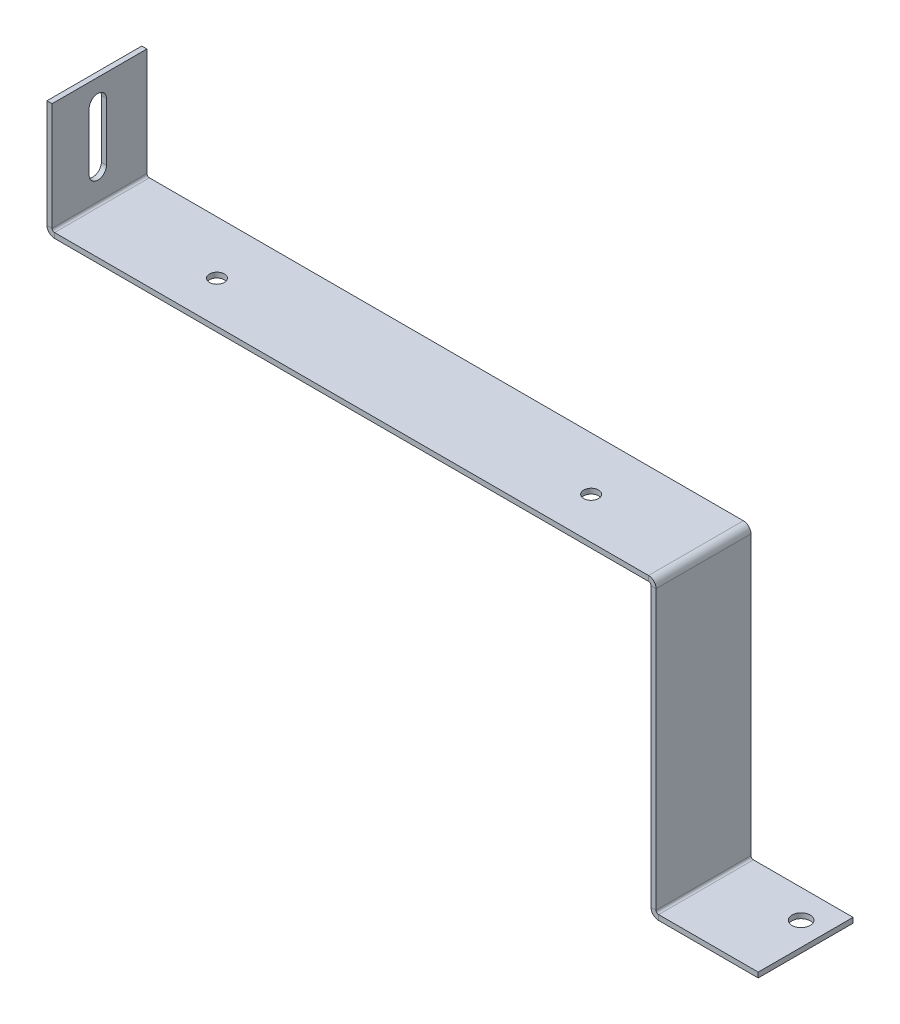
ISO-10303-21;
HEADER;
FILE_DESCRIPTION(('STEP AP214'),'2;1');
FILE_NAME('part.step','',(''),(''),'','','');
FILE_SCHEMA(('AUTOMOTIVE_DESIGN { 1 0 10303 214 1 1 1 1 }'));
ENDSEC;
DATA;
#1=APPLICATION_CONTEXT('core data for automotive mechanical design processes');
#2=APPLICATION_PROTOCOL_DEFINITION('international standard','automotive_design',2000,#1);
#3=PRODUCT_CONTEXT('',#1,'mechanical');
#4=PRODUCT('Part','Part','',(#3));
#5=PRODUCT_RELATED_PRODUCT_CATEGORY('part','',(#4));
#6=PRODUCT_DEFINITION_FORMATION('','',#4);
#7=PRODUCT_DEFINITION_CONTEXT('part definition',#1,'design');
#8=PRODUCT_DEFINITION('design','',#6,#7);
#9=PRODUCT_DEFINITION_SHAPE('','',#8);
#10=(LENGTH_UNIT() NAMED_UNIT(*) SI_UNIT(.MILLI.,.METRE.));
#11=(NAMED_UNIT(*) PLANE_ANGLE_UNIT() SI_UNIT($,.RADIAN.));
#12=(NAMED_UNIT(*) SI_UNIT($,.STERADIAN.) SOLID_ANGLE_UNIT());
#13=UNCERTAINTY_MEASURE_WITH_UNIT(LENGTH_MEASURE(1.E-05),#10,'distance_accuracy_value','');
#14=(GEOMETRIC_REPRESENTATION_CONTEXT(3) GLOBAL_UNCERTAINTY_ASSIGNED_CONTEXT((#13)) GLOBAL_UNIT_ASSIGNED_CONTEXT((#10,
#11,#12)) REPRESENTATION_CONTEXT('',''));
#15=CARTESIAN_POINT('',(0.,0.,0.));
#16=DIRECTION('',(0.,0.,1.));
#17=DIRECTION('',(1.,0.,0.));
#18=AXIS2_PLACEMENT_3D('',#15,#16,#17);
#19=CARTESIAN_POINT('',(186.055,-88.9000000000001,29.21));
#20=DIRECTION('',(0.,1.,0.));
#21=DIRECTION('',(0.,0.,1.));
#22=AXIS2_PLACEMENT_3D('',#19,#20,#21);
#23=PLANE('',#22);
#24=DIRECTION('',(1.,0.,0.));
#25=VECTOR('',#24,1.);
#26=CARTESIAN_POINT('',(186.055,-88.9000000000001,29.21));
#27=LINE('',#26,#25);
#28=CARTESIAN_POINT('',(188.3918,-88.9,29.21));
#29=VERTEX_POINT('',#28);
#30=CARTESIAN_POINT('',(219.075,-88.9000000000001,29.21));
#31=VERTEX_POINT('',#30);
#32=EDGE_CURVE('E368',#29,#31,#27,.T.);
#33=ORIENTED_EDGE('',*,*,#32,.F.);
#34=DIRECTION('',(0.,0.,-1.));
#35=VECTOR('',#34,1.);
#36=CARTESIAN_POINT('',(188.3918,-88.9000000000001,29.21));
#37=LINE('',#36,#35);
#38=CARTESIAN_POINT('',(188.3918,-88.9000000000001,0.));
#39=VERTEX_POINT('',#38);
#40=EDGE_CURVE('E365',#29,#39,#37,.T.);
#41=ORIENTED_EDGE('',*,*,#40,.T.);
#42=DIRECTION('',(1.,0.,0.));
#43=VECTOR('',#42,1.);
#44=CARTESIAN_POINT('',(186.055,-88.9000000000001,0.));
#45=LINE('',#44,#43);
#46=CARTESIAN_POINT('',(219.075,-88.9000000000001,0.));
#47=VERTEX_POINT('',#46);
#48=EDGE_CURVE('E362',#39,#47,#45,.T.);
#49=ORIENTED_EDGE('',*,*,#48,.T.);
#50=DIRECTION('',(0.,0.,-1.));
#51=VECTOR('',#50,1.);
#52=CARTESIAN_POINT('',(219.075,-88.9000000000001,29.21));
#53=LINE('',#52,#51);
#54=EDGE_CURVE('E373',#31,#47,#53,.T.);
#55=ORIENTED_EDGE('',*,*,#54,.F.);
#56=EDGE_LOOP('',(#33,#41,#49,#55));
#57=FACE_BOUND('',#56,.T.);
#58=CARTESIAN_POINT('',(211.836,-88.9000000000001,8.76300000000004));
#59=DIRECTION('',(0.,1.,0.));
#60=DIRECTION('',(0.,0.,1.));
#61=AXIS2_PLACEMENT_3D('',#58,#59,#60);
#62=CIRCLE('',#61,2.79399999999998);
#63=CARTESIAN_POINT('',(211.836,-88.9000000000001,11.557));
#64=VERTEX_POINT('',#63);
#65=EDGE_CURVE('E214',#64,#64,#62,.T.);
#66=ORIENTED_EDGE('',*,*,#65,.T.);
#67=EDGE_LOOP('',(#66));
#68=FACE_BOUND('',#67,.T.);
#69=ADVANCED_FACE('F38',(#57,#68),#23,.F.);
#70=CARTESIAN_POINT('',(186.055,-87.3252000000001,29.21));
#71=DIRECTION('',(0.,1.,0.));
#72=DIRECTION('',(0.,0.,1.));
#73=AXIS2_PLACEMENT_3D('',#70,#71,#72);
#74=PLANE('',#73);
#75=DIRECTION('',(0.,0.,-1.));
#76=VECTOR('',#75,1.);
#77=CARTESIAN_POINT('',(188.3918,-87.3252000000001,29.21));
#78=LINE('',#77,#76);
#79=CARTESIAN_POINT('',(188.3918,-87.3252000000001,29.21));
#80=VERTEX_POINT('',#79);
#81=CARTESIAN_POINT('',(188.3918,-87.3252000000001,1.11022302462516E-13));
#82=VERTEX_POINT('',#81);
#83=EDGE_CURVE('E322',#80,#82,#78,.T.);
#84=ORIENTED_EDGE('',*,*,#83,.F.);
#85=DIRECTION('',(1.,0.,0.));
#86=VECTOR('',#85,1.);
#87=CARTESIAN_POINT('',(186.055,-87.3252000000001,29.21));
#88=LINE('',#87,#86);
#89=CARTESIAN_POINT('',(219.075,-87.3252000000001,29.21));
#90=VERTEX_POINT('',#89);
#91=EDGE_CURVE('E355',#80,#90,#88,.T.);
#92=ORIENTED_EDGE('',*,*,#91,.T.);
#93=DIRECTION('',(0.,0.,-1.));
#94=VECTOR('',#93,1.);
#95=CARTESIAN_POINT('',(219.075,-87.3252000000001,29.21));
#96=LINE('',#95,#94);
#97=CARTESIAN_POINT('',(219.075,-87.3252000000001,0.));
#98=VERTEX_POINT('',#97);
#99=EDGE_CURVE('E352',#90,#98,#96,.T.);
#100=ORIENTED_EDGE('',*,*,#99,.T.);
#101=DIRECTION('',(1.,0.,0.));
#102=VECTOR('',#101,1.);
#103=CARTESIAN_POINT('',(186.055,-87.3252000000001,0.));
#104=LINE('',#103,#102);
#105=EDGE_CURVE('E359',#82,#98,#104,.T.);
#106=ORIENTED_EDGE('',*,*,#105,.F.);
#107=EDGE_LOOP('',(#84,#92,#100,#106));
#108=FACE_BOUND('',#107,.T.);
#109=CARTESIAN_POINT('',(211.836,-87.3252000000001,8.76300000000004));
#110=DIRECTION('',(0.,1.,0.));
#111=DIRECTION('',(0.,0.,1.));
#112=AXIS2_PLACEMENT_3D('',#109,#110,#111);
#113=CIRCLE('',#112,2.79399999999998);
#114=CARTESIAN_POINT('',(211.836,-87.3252000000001,11.557));
#115=VERTEX_POINT('',#114);
#116=EDGE_CURVE('E217',#115,#115,#113,.T.);
#117=ORIENTED_EDGE('',*,*,#116,.F.);
#118=EDGE_LOOP('',(#117));
#119=FACE_BOUND('',#118,.T.);
#120=ADVANCED_FACE('F40',(#108,#119),#74,.T.);
#121=CARTESIAN_POINT('',(219.075,-2.59780508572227,29.21));
#122=DIRECTION('',(-1.,0.,0.));
#123=DIRECTION('',(0.,0.,1.));
#124=AXIS2_PLACEMENT_3D('',#121,#122,#123);
#125=PLANE('',#124);
#126=DIRECTION('',(0.,-1.,0.));
#127=VECTOR('',#126,1.);
#128=CARTESIAN_POINT('',(219.075,-2.59780508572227,29.21));
#129=LINE('',#128,#127);
#130=EDGE_CURVE('E376',#90,#31,#129,.T.);
#131=ORIENTED_EDGE('',*,*,#130,.T.);
#132=ORIENTED_EDGE('',*,*,#54,.T.);
#133=DIRECTION('',(0.,-1.,0.));
#134=VECTOR('',#133,1.);
#135=CARTESIAN_POINT('',(219.075,-2.59780508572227,0.));
#136=LINE('',#135,#134);
#137=EDGE_CURVE('E357',#98,#47,#136,.T.);
#138=ORIENTED_EDGE('',*,*,#137,.F.);
#139=ORIENTED_EDGE('',*,*,#99,.F.);
#140=EDGE_LOOP('',(#131,#132,#138,#139));
#141=FACE_BOUND('',#140,.T.);
#142=ADVANCED_FACE('F412',(#141),#125,.F.);
#143=CARTESIAN_POINT('',(186.055,-2.59780508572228,29.21));
#144=DIRECTION('',(0.,0.,-1.));
#145=DIRECTION('',(-1.,0.,0.));
#146=AXIS2_PLACEMENT_3D('',#143,#144,#145);
#147=PLANE('',#146);
#148=DIRECTION('',(0.,-1.,0.));
#149=VECTOR('',#148,1.);
#150=CARTESIAN_POINT('',(188.3918,-2.59780508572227,29.21));
#151=LINE('',#150,#149);
#152=EDGE_CURVE('E370',#80,#29,#151,.T.);
#153=ORIENTED_EDGE('',*,*,#152,.T.);
#154=ORIENTED_EDGE('',*,*,#32,.T.);
#155=ORIENTED_EDGE('',*,*,#130,.F.);
#156=ORIENTED_EDGE('',*,*,#91,.F.);
#157=EDGE_LOOP('',(#153,#154,#155,#156));
#158=FACE_BOUND('',#157,.T.);
#159=ADVANCED_FACE('F417',(#158),#147,.F.);
#160=CARTESIAN_POINT('',(186.055,-2.59780508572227,0.));
#161=DIRECTION('',(0.,0.,-1.));
#162=DIRECTION('',(-1.,0.,0.));
#163=AXIS2_PLACEMENT_3D('',#160,#161,#162);
#164=PLANE('',#163);
#165=ORIENTED_EDGE('',*,*,#48,.F.);
#166=DIRECTION('',(0.,-1.,0.));
#167=VECTOR('',#166,1.);
#168=CARTESIAN_POINT('',(188.3918,-2.59780508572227,0.));
#169=LINE('',#168,#167);
#170=EDGE_CURVE('E379',#82,#39,#169,.T.);
#171=ORIENTED_EDGE('',*,*,#170,.F.);
#172=ORIENTED_EDGE('',*,*,#105,.T.);
#173=ORIENTED_EDGE('',*,*,#137,.T.);
#174=EDGE_LOOP('',(#165,#171,#172,#173));
#175=FACE_BOUND('',#174,.T.);
#176=ADVANCED_FACE('F419',(#175),#164,.T.);
#177=CARTESIAN_POINT('',(90.0509011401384,35.56,29.21));
#178=DIRECTION('',(0.,1.,0.));
#179=DIRECTION('',(-1.,0.,0.));
#180=AXIS2_PLACEMENT_3D('',#177,#178,#179);
#181=PLANE('',#180);
#182=DIRECTION('',(0.,0.,-1.));
#183=VECTOR('',#182,1.);
#184=CARTESIAN_POINT('',(0.,35.56,29.21));
#185=LINE('',#184,#183);
#186=CARTESIAN_POINT('',(0.,35.56,29.21));
#187=VERTEX_POINT('',#186);
#188=CARTESIAN_POINT('',(0.,35.56,0.));
#189=VERTEX_POINT('',#188);
#190=EDGE_CURVE('E329',#187,#189,#185,.T.);
#191=ORIENTED_EDGE('',*,*,#190,.F.);
#192=DIRECTION('',(-1.,0.,0.));
#193=VECTOR('',#192,1.);
#194=CARTESIAN_POINT('',(90.0509011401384,35.56,29.21));
#195=LINE('',#194,#193);
#196=CARTESIAN_POINT('',(1.57479999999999,35.56,29.21));
#197=VERTEX_POINT('',#196);
#198=EDGE_CURVE('E326',#197,#187,#195,.T.);
#199=ORIENTED_EDGE('',*,*,#198,.F.);
#200=DIRECTION('',(0.,0.,-1.));
#201=VECTOR('',#200,1.);
#202=CARTESIAN_POINT('',(1.57479999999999,35.56,29.21));
#203=LINE('',#202,#201);
#204=CARTESIAN_POINT('',(1.57479999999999,35.56,0.));
#205=VERTEX_POINT('',#204);
#206=EDGE_CURVE('E346',#197,#205,#203,.T.);
#207=ORIENTED_EDGE('',*,*,#206,.T.);
#208=DIRECTION('',(-1.,0.,0.));
#209=VECTOR('',#208,1.);
#210=CARTESIAN_POINT('',(90.0509011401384,35.56,0.));
#211=LINE('',#210,#209);
#212=EDGE_CURVE('E343',#205,#189,#211,.T.);
#213=ORIENTED_EDGE('',*,*,#212,.T.);
#214=EDGE_LOOP('',(#191,#199,#207,#213));
#215=FACE_BOUND('',#214,.T.);
#216=ADVANCED_FACE('F421',(#215),#181,.T.);
#217=CARTESIAN_POINT('',(90.0509011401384,35.56,0.));
#218=DIRECTION('',(0.,0.,-1.));
#219=DIRECTION('',(0.,1.,0.));
#220=AXIS2_PLACEMENT_3D('',#217,#218,#219);
#221=PLANE('',#220);
#222=DIRECTION('',(0.,-1.,0.));
#223=VECTOR('',#222,1.);
#224=CARTESIAN_POINT('',(0.,35.56,0.));
#225=LINE('',#224,#223);
#226=CARTESIAN_POINT('',(0.,2.3368,0.));
#227=VERTEX_POINT('',#226);
#228=EDGE_CURVE('E334',#189,#227,#225,.T.);
#229=ORIENTED_EDGE('',*,*,#228,.F.);
#230=ORIENTED_EDGE('',*,*,#212,.F.);
#231=DIRECTION('',(0.,-1.,0.));
#232=VECTOR('',#231,1.);
#233=CARTESIAN_POINT('',(1.57479999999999,35.56,0.));
#234=LINE('',#233,#232);
#235=CARTESIAN_POINT('',(1.57479999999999,2.3368,0.));
#236=VERTEX_POINT('',#235);
#237=EDGE_CURVE('E340',#205,#236,#234,.T.);
#238=ORIENTED_EDGE('',*,*,#237,.T.);
#239=DIRECTION('',(-1.,0.,0.));
#240=VECTOR('',#239,1.);
#241=CARTESIAN_POINT('',(90.0509011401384,2.33679999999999,0.));
#242=LINE('',#241,#240);
#243=EDGE_CURVE('E337',#236,#227,#242,.T.);
#244=ORIENTED_EDGE('',*,*,#243,.T.);
#245=EDGE_LOOP('',(#229,#230,#238,#244));
#246=FACE_BOUND('',#245,.T.);
#247=ADVANCED_FACE('F427',(#246),#221,.T.);
#248=CARTESIAN_POINT('',(0.,35.56,29.21));
#249=DIRECTION('',(1.,0.,0.));
#250=DIRECTION('',(0.,1.,0.));
#251=AXIS2_PLACEMENT_3D('',#248,#249,#250);
#252=PLANE('',#251);
#253=DIRECTION('',(0.,1.,0.));
#254=VECTOR('',#253,1.);
#255=CARTESIAN_POINT('',(0.,10.795,17.78));
#256=LINE('',#255,#254);
#257=CARTESIAN_POINT('',(0.,10.795,17.78));
#258=VERTEX_POINT('',#257);
#259=CARTESIAN_POINT('',(4.44089209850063E-13,28.575,17.78));
#260=VERTEX_POINT('',#259);
#261=EDGE_CURVE('E186',#258,#260,#256,.T.);
#262=ORIENTED_EDGE('',*,*,#261,.F.);
#263=CARTESIAN_POINT('',(0.,10.795,15.113));
#264=DIRECTION('',(-1.,0.,0.));
#265=DIRECTION('',(0.,-1.,0.));
#266=AXIS2_PLACEMENT_3D('',#263,#264,#265);
#267=CIRCLE('',#266,2.667);
#268=CARTESIAN_POINT('',(0.,10.795,12.446));
#269=VERTEX_POINT('',#268);
#270=EDGE_CURVE('E53',#269,#258,#267,.T.);
#271=ORIENTED_EDGE('',*,*,#270,.F.);
#272=DIRECTION('',(0.,-1.,0.));
#273=VECTOR('',#272,1.);
#274=CARTESIAN_POINT('',(0.,10.795,12.446));
#275=LINE('',#274,#273);
#276=CARTESIAN_POINT('',(4.44089209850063E-13,28.575,12.446));
#277=VERTEX_POINT('',#276);
#278=EDGE_CURVE('E193',#277,#269,#275,.T.);
#279=ORIENTED_EDGE('',*,*,#278,.F.);
#280=CARTESIAN_POINT('',(4.44089209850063E-13,28.575,15.113));
#281=DIRECTION('',(-1.,0.,0.));
#282=DIRECTION('',(0.,-1.,0.));
#283=AXIS2_PLACEMENT_3D('',#280,#281,#282);
#284=CIRCLE('',#283,2.667);
#285=EDGE_CURVE('E177',#260,#277,#284,.T.);
#286=ORIENTED_EDGE('',*,*,#285,.F.);
#287=EDGE_LOOP('',(#262,#271,#279,#286));
#288=FACE_BOUND('',#287,.T.);
#289=ORIENTED_EDGE('',*,*,#228,.T.);
#290=DIRECTION('',(0.,0.,1.));
#291=VECTOR('',#290,1.);
#292=CARTESIAN_POINT('',(0.,2.3368,0.));
#293=LINE('',#292,#291);
#294=CARTESIAN_POINT('',(0.,2.3368,29.21));
#295=VERTEX_POINT('',#294);
#296=EDGE_CURVE('E331',#227,#295,#293,.T.);
#297=ORIENTED_EDGE('',*,*,#296,.T.);
#298=DIRECTION('',(0.,-1.,0.));
#299=VECTOR('',#298,1.);
#300=CARTESIAN_POINT('',(0.,35.56,29.21));
#301=LINE('',#300,#299);
#302=EDGE_CURVE('E323',#187,#295,#301,.T.);
#303=ORIENTED_EDGE('',*,*,#302,.F.);
#304=ORIENTED_EDGE('',*,*,#190,.T.);
#305=EDGE_LOOP('',(#289,#297,#303,#304));
#306=FACE_BOUND('',#305,.T.);
#307=ADVANCED_FACE('F190',(#288,#306),#252,.F.);
#308=CARTESIAN_POINT('',(90.0509011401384,35.56,29.21));
#309=DIRECTION('',(0.,0.,-1.));
#310=DIRECTION('',(0.,1.,0.));
#311=AXIS2_PLACEMENT_3D('',#308,#309,#310);
#312=PLANE('',#311);
#313=ORIENTED_EDGE('',*,*,#198,.T.);
#314=ORIENTED_EDGE('',*,*,#302,.T.);
#315=DIRECTION('',(-1.,0.,0.));
#316=VECTOR('',#315,1.);
#317=CARTESIAN_POINT('',(90.0509011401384,2.3368,29.21));
#318=LINE('',#317,#316);
#319=CARTESIAN_POINT('',(1.57479999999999,2.3368,29.21));
#320=VERTEX_POINT('',#319);
#321=EDGE_CURVE('E348',#320,#295,#318,.T.);
#322=ORIENTED_EDGE('',*,*,#321,.F.);
#323=DIRECTION('',(0.,-1.,0.));
#324=VECTOR('',#323,1.);
#325=CARTESIAN_POINT('',(1.57479999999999,35.56,29.21));
#326=LINE('',#325,#324);
#327=EDGE_CURVE('E319',#197,#320,#326,.T.);
#328=ORIENTED_EDGE('',*,*,#327,.F.);
#329=EDGE_LOOP('',(#313,#314,#322,#328));
#330=FACE_BOUND('',#329,.T.);
#331=ADVANCED_FACE('F458',(#330),#312,.F.);
#332=CARTESIAN_POINT('',(1.57479999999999,35.56,29.21));
#333=DIRECTION('',(1.,0.,0.));
#334=DIRECTION('',(0.,1.,0.));
#335=AXIS2_PLACEMENT_3D('',#332,#333,#334);
#336=PLANE('',#335);
#337=CARTESIAN_POINT('',(1.57479999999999,10.795,15.113));
#338=DIRECTION('',(1.,0.,0.));
#339=DIRECTION('',(0.,1.,0.));
#340=AXIS2_PLACEMENT_3D('',#337,#338,#339);
#341=CIRCLE('',#340,2.667);
#342=CARTESIAN_POINT('',(1.57479999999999,10.795,17.78));
#343=VERTEX_POINT('',#342);
#344=CARTESIAN_POINT('',(1.57479999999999,10.795,12.446));
#345=VERTEX_POINT('',#344);
#346=EDGE_CURVE('E11',#343,#345,#341,.T.);
#347=ORIENTED_EDGE('',*,*,#346,.F.);
#348=DIRECTION('',(0.,-1.,0.));
#349=VECTOR('',#348,1.);
#350=CARTESIAN_POINT('',(1.57479999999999,35.56,17.78));
#351=LINE('',#350,#349);
#352=CARTESIAN_POINT('',(1.57480000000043,28.575,17.78));
#353=VERTEX_POINT('',#352);
#354=EDGE_CURVE('E354',#353,#343,#351,.T.);
#355=ORIENTED_EDGE('',*,*,#354,.F.);
#356=CARTESIAN_POINT('',(1.57480000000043,28.575,15.113));
#357=DIRECTION('',(1.,0.,0.));
#358=DIRECTION('',(0.,1.,0.));
#359=AXIS2_PLACEMENT_3D('',#356,#357,#358);
#360=CIRCLE('',#359,2.667);
#361=CARTESIAN_POINT('',(1.57480000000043,28.575,12.446));
#362=VERTEX_POINT('',#361);
#363=EDGE_CURVE('E180',#362,#353,#360,.T.);
#364=ORIENTED_EDGE('',*,*,#363,.F.);
#365=DIRECTION('',(0.,1.,0.));
#366=VECTOR('',#365,1.);
#367=CARTESIAN_POINT('',(1.57479999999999,35.56,12.446));
#368=LINE('',#367,#366);
#369=EDGE_CURVE('E46',#345,#362,#368,.T.);
#370=ORIENTED_EDGE('',*,*,#369,.F.);
#371=EDGE_LOOP('',(#347,#355,#364,#370));
#372=FACE_BOUND('',#371,.T.);
#373=DIRECTION('',(0.,0.,1.));
#374=VECTOR('',#373,1.);
#375=CARTESIAN_POINT('',(1.57479999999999,2.3368,0.));
#376=LINE('',#375,#374);
#377=EDGE_CURVE('E288',#236,#320,#376,.T.);
#378=ORIENTED_EDGE('',*,*,#377,.F.);
#379=ORIENTED_EDGE('',*,*,#237,.F.);
#380=ORIENTED_EDGE('',*,*,#206,.F.);
#381=ORIENTED_EDGE('',*,*,#327,.T.);
#382=EDGE_LOOP('',(#378,#379,#380,#381));
#383=FACE_BOUND('',#382,.T.);
#384=ADVANCED_FACE('F391',(#372,#383),#336,.T.);
#385=CARTESIAN_POINT('',(6.35575308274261,0.,0.));
#386=DIRECTION('',(0.,0.,1.));
#387=DIRECTION('',(0.,-1.,0.));
#388=AXIS2_PLACEMENT_3D('',#385,#386,#387);
#389=PLANE('',#388);
#390=DIRECTION('',(0.,1.,0.));
#391=VECTOR('',#390,1.);
#392=CARTESIAN_POINT('',(187.6298,0.,0.));
#393=LINE('',#392,#391);
#394=CARTESIAN_POINT('',(187.6298,-86.5632000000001,1.07552855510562E-13));
#395=VERTEX_POINT('',#394);
#396=CARTESIAN_POINT('',(187.6298,-0.761999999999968,0.));
#397=VERTEX_POINT('',#396);
#398=EDGE_CURVE('E301',#395,#397,#393,.T.);
#399=ORIENTED_EDGE('',*,*,#398,.F.);
#400=DIRECTION('',(1.,0.,0.));
#401=VECTOR('',#400,1.);
#402=CARTESIAN_POINT('',(6.35575308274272,-86.5632000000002,0.));
#403=LINE('',#402,#401);
#404=CARTESIAN_POINT('',(186.055,-86.5632000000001,1.11022302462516E-13));
#405=VERTEX_POINT('',#404);
#406=EDGE_CURVE('E309',#405,#395,#403,.T.);
#407=ORIENTED_EDGE('',*,*,#406,.F.);
#408=DIRECTION('',(0.,1.,0.));
#409=VECTOR('',#408,1.);
#410=CARTESIAN_POINT('',(186.055,0.,0.));
#411=LINE('',#410,#409);
#412=CARTESIAN_POINT('',(186.055,-0.761999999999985,0.));
#413=VERTEX_POINT('',#412);
#414=EDGE_CURVE('E306',#405,#413,#411,.T.);
#415=ORIENTED_EDGE('',*,*,#414,.T.);
#416=DIRECTION('',(1.,0.,0.));
#417=VECTOR('',#416,1.);
#418=CARTESIAN_POINT('',(6.35575308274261,-0.761999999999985,0.));
#419=LINE('',#418,#417);
#420=EDGE_CURVE('E303',#413,#397,#419,.T.);
#421=ORIENTED_EDGE('',*,*,#420,.T.);
#422=EDGE_LOOP('',(#399,#407,#415,#421));
#423=FACE_BOUND('',#422,.T.);
#424=ADVANCED_FACE('F457',(#423),#389,.F.);
#425=CARTESIAN_POINT('',(187.6298,0.,29.21));
#426=DIRECTION('',(1.,0.,0.));
#427=DIRECTION('',(0.,0.,-1.));
#428=AXIS2_PLACEMENT_3D('',#425,#426,#427);
#429=PLANE('',#428);
#430=DIRECTION('',(0.,0.,1.));
#431=VECTOR('',#430,1.);
#432=CARTESIAN_POINT('',(187.6298,-86.5632000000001,29.21));
#433=LINE('',#432,#431);
#434=CARTESIAN_POINT('',(187.6298,-86.5632000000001,29.21));
#435=VERTEX_POINT('',#434);
#436=EDGE_CURVE('E311',#395,#435,#433,.T.);
#437=ORIENTED_EDGE('',*,*,#436,.F.);
#438=ORIENTED_EDGE('',*,*,#398,.T.);
#439=DIRECTION('',(0.,0.,-1.));
#440=VECTOR('',#439,1.);
#441=CARTESIAN_POINT('',(187.6298,-0.761999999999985,0.));
#442=LINE('',#441,#440);
#443=CARTESIAN_POINT('',(187.6298,-0.762000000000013,29.21));
#444=VERTEX_POINT('',#443);
#445=EDGE_CURVE('E314',#444,#397,#442,.T.);
#446=ORIENTED_EDGE('',*,*,#445,.F.);
#447=DIRECTION('',(0.,1.,0.));
#448=VECTOR('',#447,1.);
#449=CARTESIAN_POINT('',(187.6298,0.,29.21));
#450=LINE('',#449,#448);
#451=EDGE_CURVE('E298',#444,#435,#450,.F.);
#452=ORIENTED_EDGE('',*,*,#451,.T.);
#453=EDGE_LOOP('',(#437,#438,#446,#452));
#454=FACE_BOUND('',#453,.T.);
#455=ADVANCED_FACE('F475',(#454),#429,.T.);
#456=CARTESIAN_POINT('',(6.35575308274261,0.,29.21));
#457=DIRECTION('',(0.,0.,1.));
#458=DIRECTION('',(0.,-1.,0.));
#459=AXIS2_PLACEMENT_3D('',#456,#457,#458);
#460=PLANE('',#459);
#461=DIRECTION('',(1.,0.,0.));
#462=VECTOR('',#461,1.);
#463=CARTESIAN_POINT('',(6.35575308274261,-86.5632000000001,29.21));
#464=LINE('',#463,#462);
#465=CARTESIAN_POINT('',(186.055,-86.5632000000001,29.21));
#466=VERTEX_POINT('',#465);
#467=EDGE_CURVE('E295',#466,#435,#464,.T.);
#468=ORIENTED_EDGE('',*,*,#467,.T.);
#469=ORIENTED_EDGE('',*,*,#451,.F.);
#470=DIRECTION('',(1.,0.,0.));
#471=VECTOR('',#470,1.);
#472=CARTESIAN_POINT('',(6.35575308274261,-0.761999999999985,29.21));
#473=LINE('',#472,#471);
#474=CARTESIAN_POINT('',(186.055,-0.762000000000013,29.21));
#475=VERTEX_POINT('',#474);
#476=EDGE_CURVE('E285',#475,#444,#473,.T.);
#477=ORIENTED_EDGE('',*,*,#476,.F.);
#478=DIRECTION('',(0.,-1.,0.));
#479=VECTOR('',#478,1.);
#480=CARTESIAN_POINT('',(186.055,0.,29.21));
#481=LINE('',#480,#479);
#482=EDGE_CURVE('E292',#475,#466,#481,.T.);
#483=ORIENTED_EDGE('',*,*,#482,.T.);
#484=EDGE_LOOP('',(#468,#469,#477,#483));
#485=FACE_BOUND('',#484,.T.);
#486=ADVANCED_FACE('F471',(#485),#460,.T.);
#487=CARTESIAN_POINT('',(186.055,0.,29.21));
#488=DIRECTION('',(1.,0.,0.));
#489=DIRECTION('',(0.,0.,-1.));
#490=AXIS2_PLACEMENT_3D('',#487,#488,#489);
#491=PLANE('',#490);
#492=ORIENTED_EDGE('',*,*,#414,.F.);
#493=DIRECTION('',(0.,0.,1.));
#494=VECTOR('',#493,1.);
#495=CARTESIAN_POINT('',(186.055,-86.5632000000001,29.21));
#496=LINE('',#495,#494);
#497=EDGE_CURVE('E289',#405,#466,#496,.T.);
#498=ORIENTED_EDGE('',*,*,#497,.T.);
#499=ORIENTED_EDGE('',*,*,#482,.F.);
#500=DIRECTION('',(0.,0.,-1.));
#501=VECTOR('',#500,1.);
#502=CARTESIAN_POINT('',(186.055,-0.761999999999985,0.));
#503=LINE('',#502,#501);
#504=EDGE_CURVE('E286',#475,#413,#503,.T.);
#505=ORIENTED_EDGE('',*,*,#504,.T.);
#506=EDGE_LOOP('',(#492,#498,#499,#505));
#507=FACE_BOUND('',#506,.T.);
#508=ADVANCED_FACE('F467',(#507),#491,.F.);
#509=CARTESIAN_POINT('',(0.,372.121397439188,0.));
#510=DIRECTION('',(0.,0.,-1.));
#511=DIRECTION('',(-1.,0.,0.));
#512=AXIS2_PLACEMENT_3D('',#509,#510,#511);
#513=PLANE('',#512);
#514=DIRECTION('',(1.,0.,0.));
#515=VECTOR('',#514,1.);
#516=CARTESIAN_POINT('',(0.,0.,0.));
#517=LINE('',#516,#515);
#518=CARTESIAN_POINT('',(2.33680000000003,0.,0.));
#519=VERTEX_POINT('',#518);
#520=CARTESIAN_POINT('',(185.293,0.,0.));
#521=VERTEX_POINT('',#520);
#522=EDGE_CURVE('E253',#519,#521,#517,.T.);
#523=ORIENTED_EDGE('',*,*,#522,.F.);
#524=DIRECTION('',(0.,-1.,0.));
#525=VECTOR('',#524,1.);
#526=CARTESIAN_POINT('',(2.33680000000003,372.121397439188,0.));
#527=LINE('',#526,#525);
#528=CARTESIAN_POINT('',(2.33680000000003,1.5748,0.));
#529=VERTEX_POINT('',#528);
#530=EDGE_CURVE('E274',#529,#519,#527,.T.);
#531=ORIENTED_EDGE('',*,*,#530,.F.);
#532=DIRECTION('',(1.,0.,0.));
#533=VECTOR('',#532,1.);
#534=CARTESIAN_POINT('',(0.,1.5748,0.));
#535=LINE('',#534,#533);
#536=CARTESIAN_POINT('',(185.293,1.5748,0.));
#537=VERTEX_POINT('',#536);
#538=EDGE_CURVE('E261',#529,#537,#535,.T.);
#539=ORIENTED_EDGE('',*,*,#538,.T.);
#540=DIRECTION('',(0.,-1.,0.));
#541=VECTOR('',#540,1.);
#542=CARTESIAN_POINT('',(185.293,372.121397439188,0.));
#543=LINE('',#542,#541);
#544=EDGE_CURVE('E276',#537,#521,#543,.T.);
#545=ORIENTED_EDGE('',*,*,#544,.T.);
#546=EDGE_LOOP('',(#523,#531,#539,#545));
#547=FACE_BOUND('',#546,.T.);
#548=ADVANCED_FACE('F470',(#547),#513,.T.);
#549=CARTESIAN_POINT('',(0.,372.121397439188,29.21));
#550=DIRECTION('',(0.,0.,-1.));
#551=DIRECTION('',(-1.,0.,0.));
#552=AXIS2_PLACEMENT_3D('',#549,#550,#551);
#553=PLANE('',#552);
#554=DIRECTION('',(0.,-1.,0.));
#555=VECTOR('',#554,1.);
#556=CARTESIAN_POINT('',(2.33680000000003,372.121397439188,29.21));
#557=LINE('',#556,#555);
#558=CARTESIAN_POINT('',(2.33680000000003,1.57479999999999,29.21));
#559=VERTEX_POINT('',#558);
#560=CARTESIAN_POINT('',(2.33680000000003,0.,29.21));
#561=VERTEX_POINT('',#560);
#562=EDGE_CURVE('E271',#559,#561,#557,.T.);
#563=ORIENTED_EDGE('',*,*,#562,.T.);
#564=DIRECTION('',(1.,0.,0.));
#565=VECTOR('',#564,1.);
#566=CARTESIAN_POINT('',(0.,0.,29.21));
#567=LINE('',#566,#565);
#568=CARTESIAN_POINT('',(185.293,0.,29.21));
#569=VERTEX_POINT('',#568);
#570=EDGE_CURVE('E282',#561,#569,#567,.T.);
#571=ORIENTED_EDGE('',*,*,#570,.T.);
#572=DIRECTION('',(0.,-1.,0.));
#573=VECTOR('',#572,1.);
#574=CARTESIAN_POINT('',(185.293,372.121397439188,29.21));
#575=LINE('',#574,#573);
#576=CARTESIAN_POINT('',(185.293,1.57479999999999,29.21));
#577=VERTEX_POINT('',#576);
#578=EDGE_CURVE('E269',#577,#569,#575,.T.);
#579=ORIENTED_EDGE('',*,*,#578,.F.);
#580=DIRECTION('',(1.,0.,0.));
#581=VECTOR('',#580,1.);
#582=CARTESIAN_POINT('',(0.,1.57479999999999,29.21));
#583=LINE('',#582,#581);
#584=EDGE_CURVE('E279',#559,#577,#583,.T.);
#585=ORIENTED_EDGE('',*,*,#584,.F.);
#586=EDGE_LOOP('',(#563,#571,#579,#585));
#587=FACE_BOUND('',#586,.T.);
#588=ADVANCED_FACE('F485',(#587),#553,.F.);
#589=CARTESIAN_POINT('',(0.,1.5748,29.21));
#590=DIRECTION('',(0.,1.,0.));
#591=DIRECTION('',(0.,0.,1.));
#592=AXIS2_PLACEMENT_3D('',#589,#590,#591);
#593=PLANE('',#592);
#594=CARTESIAN_POINT('',(39.5224,1.57479999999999,16.383));
#595=DIRECTION('',(0.,1.,0.));
#596=DIRECTION('',(0.,0.,1.));
#597=AXIS2_PLACEMENT_3D('',#594,#595,#596);
#598=CIRCLE('',#597,2.286);
#599=CARTESIAN_POINT('',(39.5224,1.57479999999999,18.669));
#600=VERTEX_POINT('',#599);
#601=EDGE_CURVE('E200',#600,#600,#598,.T.);
#602=ORIENTED_EDGE('',*,*,#601,.F.);
#603=EDGE_LOOP('',(#602));
#604=FACE_BOUND('',#603,.T.);
#605=CARTESIAN_POINT('',(154.7876,1.5748,16.383));
#606=DIRECTION('',(0.,1.,0.));
#607=DIRECTION('',(0.,0.,1.));
#608=AXIS2_PLACEMENT_3D('',#605,#606,#607);
#609=CIRCLE('',#608,2.28600000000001);
#610=CARTESIAN_POINT('',(154.7876,1.5748,18.669));
#611=VERTEX_POINT('',#610);
#612=EDGE_CURVE('E208',#611,#611,#609,.T.);
#613=ORIENTED_EDGE('',*,*,#612,.F.);
#614=EDGE_LOOP('',(#613));
#615=FACE_BOUND('',#614,.T.);
#616=DIRECTION('',(0.,0.,1.));
#617=VECTOR('',#616,1.);
#618=CARTESIAN_POINT('',(185.293,1.57479999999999,0.));
#619=LINE('',#618,#617);
#620=EDGE_CURVE('E267',#537,#577,#619,.T.);
#621=ORIENTED_EDGE('',*,*,#620,.F.);
#622=ORIENTED_EDGE('',*,*,#538,.F.);
#623=DIRECTION('',(0.,0.,1.));
#624=VECTOR('',#623,1.);
#625=CARTESIAN_POINT('',(2.33680000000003,1.57479999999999,0.));
#626=LINE('',#625,#624);
#627=EDGE_CURVE('E264',#529,#559,#626,.T.);
#628=ORIENTED_EDGE('',*,*,#627,.T.);
#629=ORIENTED_EDGE('',*,*,#584,.T.);
#630=EDGE_LOOP('',(#621,#622,#628,#629));
#631=FACE_BOUND('',#630,.T.);
#632=ADVANCED_FACE('F489',(#604,#615,#631),#593,.T.);
#633=CARTESIAN_POINT('',(0.,0.,29.21));
#634=DIRECTION('',(0.,1.,0.));
#635=DIRECTION('',(0.,0.,1.));
#636=AXIS2_PLACEMENT_3D('',#633,#634,#635);
#637=PLANE('',#636);
#638=CARTESIAN_POINT('',(39.5224,0.,16.383));
#639=DIRECTION('',(0.,1.,0.));
#640=DIRECTION('',(0.,0.,1.));
#641=AXIS2_PLACEMENT_3D('',#638,#639,#640);
#642=CIRCLE('',#641,2.286);
#643=CARTESIAN_POINT('',(39.5224,0.,18.669));
#644=VERTEX_POINT('',#643);
#645=EDGE_CURVE('E205',#644,#644,#642,.F.);
#646=ORIENTED_EDGE('',*,*,#645,.F.);
#647=EDGE_LOOP('',(#646));
#648=FACE_BOUND('',#647,.T.);
#649=CARTESIAN_POINT('',(154.7876,0.,16.383));
#650=DIRECTION('',(0.,1.,0.));
#651=DIRECTION('',(0.,0.,1.));
#652=AXIS2_PLACEMENT_3D('',#649,#650,#651);
#653=CIRCLE('',#652,2.28600000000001);
#654=CARTESIAN_POINT('',(154.7876,0.,18.669));
#655=VERTEX_POINT('',#654);
#656=EDGE_CURVE('E211',#655,#655,#653,.F.);
#657=ORIENTED_EDGE('',*,*,#656,.F.);
#658=EDGE_LOOP('',(#657));
#659=FACE_BOUND('',#658,.T.);
#660=ORIENTED_EDGE('',*,*,#522,.T.);
#661=DIRECTION('',(0.,0.,1.));
#662=VECTOR('',#661,1.);
#663=CARTESIAN_POINT('',(185.293,0.,0.));
#664=LINE('',#663,#662);
#665=EDGE_CURVE('E258',#521,#569,#664,.T.);
#666=ORIENTED_EDGE('',*,*,#665,.T.);
#667=ORIENTED_EDGE('',*,*,#570,.F.);
#668=DIRECTION('',(0.,0.,1.));
#669=VECTOR('',#668,1.);
#670=CARTESIAN_POINT('',(2.33680000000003,0.,0.));
#671=LINE('',#670,#669);
#672=EDGE_CURVE('E256',#519,#561,#671,.T.);
#673=ORIENTED_EDGE('',*,*,#672,.F.);
#674=EDGE_LOOP('',(#660,#666,#667,#673));
#675=FACE_BOUND('',#674,.T.);
#676=ADVANCED_FACE('F493',(#648,#659,#675),#637,.F.);
#677=CARTESIAN_POINT('',(185.293,-0.762000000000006,0.));
#678=DIRECTION('',(0.,0.,1.));
#679=DIRECTION('',(1.,0.,0.));
#680=AXIS2_PLACEMENT_3D('',#677,#678,#679);
#681=PLANE('',#680);
#682=ORIENTED_EDGE('',*,*,#420,.F.);
#683=CARTESIAN_POINT('',(185.293,-0.762000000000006,0.));
#684=DIRECTION('',(0.,0.,1.));
#685=DIRECTION('',(1.,0.,0.));
#686=AXIS2_PLACEMENT_3D('',#683,#684,#685);
#687=CIRCLE('',#686,0.762000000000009);
#688=EDGE_CURVE('E244',#521,#413,#687,.F.);
#689=ORIENTED_EDGE('',*,*,#688,.F.);
#690=ORIENTED_EDGE('',*,*,#544,.F.);
#691=CARTESIAN_POINT('',(185.293,-0.762000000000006,0.));
#692=DIRECTION('',(0.,0.,1.));
#693=DIRECTION('',(1.,0.,0.));
#694=AXIS2_PLACEMENT_3D('',#691,#692,#693);
#695=CIRCLE('',#694,2.3368);
#696=EDGE_CURVE('E250',#537,#397,#695,.F.);
#697=ORIENTED_EDGE('',*,*,#696,.T.);
#698=EDGE_LOOP('',(#682,#689,#690,#697));
#699=FACE_BOUND('',#698,.T.);
#700=ADVANCED_FACE('F497',(#699),#681,.F.);
#701=CARTESIAN_POINT('',(185.293,-0.762000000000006,29.21));
#702=DIRECTION('',(0.,0.,-1.));
#703=DIRECTION('',(-1.,0.,0.));
#704=AXIS2_PLACEMENT_3D('',#701,#702,#703);
#705=PLANE('',#704);
#706=ORIENTED_EDGE('',*,*,#578,.T.);
#707=CARTESIAN_POINT('',(185.293,-0.762000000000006,29.21));
#708=DIRECTION('',(0.,0.,1.));
#709=DIRECTION('',(1.,0.,0.));
#710=AXIS2_PLACEMENT_3D('',#707,#708,#709);
#711=CIRCLE('',#710,0.762000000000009);
#712=EDGE_CURVE('E241',#475,#569,#711,.T.);
#713=ORIENTED_EDGE('',*,*,#712,.F.);
#714=ORIENTED_EDGE('',*,*,#476,.T.);
#715=CARTESIAN_POINT('',(185.293,-0.762000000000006,29.21));
#716=DIRECTION('',(0.,0.,1.));
#717=DIRECTION('',(1.,0.,0.));
#718=AXIS2_PLACEMENT_3D('',#715,#716,#717);
#719=CIRCLE('',#718,2.3368);
#720=EDGE_CURVE('E247',#444,#577,#719,.T.);
#721=ORIENTED_EDGE('',*,*,#720,.T.);
#722=EDGE_LOOP('',(#706,#713,#714,#721));
#723=FACE_BOUND('',#722,.T.);
#724=ADVANCED_FACE('F501',(#723),#705,.F.);
#725=CARTESIAN_POINT('',(185.293,-0.762000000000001,-341.221371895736));
#726=DIRECTION('',(0.,0.,1.));
#727=DIRECTION('',(1.,0.,0.));
#728=AXIS2_PLACEMENT_3D('',#725,#726,#727);
#729=CYLINDRICAL_SURFACE('',#728,2.3368);
#730=ORIENTED_EDGE('',*,*,#720,.F.);
#731=ORIENTED_EDGE('',*,*,#445,.T.);
#732=ORIENTED_EDGE('',*,*,#696,.F.);
#733=ORIENTED_EDGE('',*,*,#620,.T.);
#734=EDGE_LOOP('',(#730,#731,#732,#733));
#735=FACE_BOUND('',#734,.T.);
#736=ADVANCED_FACE('F505',(#735),#729,.T.);
#737=CARTESIAN_POINT('',(185.293,-0.762000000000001,-341.221371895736));
#738=DIRECTION('',(0.,0.,1.));
#739=DIRECTION('',(1.,0.,0.));
#740=AXIS2_PLACEMENT_3D('',#737,#738,#739);
#741=CYLINDRICAL_SURFACE('',#740,0.762000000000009);
#742=ORIENTED_EDGE('',*,*,#712,.T.);
#743=ORIENTED_EDGE('',*,*,#665,.F.);
#744=ORIENTED_EDGE('',*,*,#688,.T.);
#745=ORIENTED_EDGE('',*,*,#504,.F.);
#746=EDGE_LOOP('',(#742,#743,#744,#745));
#747=FACE_BOUND('',#746,.T.);
#748=ADVANCED_FACE('F509',(#747),#741,.F.);
#749=CARTESIAN_POINT('',(2.33680000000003,2.33679999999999,29.21));
#750=DIRECTION('',(0.,0.,1.));
#751=DIRECTION('',(1.,0.,0.));
#752=AXIS2_PLACEMENT_3D('',#749,#750,#751);
#753=PLANE('',#752);
#754=ORIENTED_EDGE('',*,*,#562,.F.);
#755=CARTESIAN_POINT('',(2.33680000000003,2.33679999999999,29.21));
#756=DIRECTION('',(0.,0.,1.));
#757=DIRECTION('',(1.,0.,0.));
#758=AXIS2_PLACEMENT_3D('',#755,#756,#757);
#759=CIRCLE('',#758,0.762);
#760=EDGE_CURVE('E233',#559,#320,#759,.F.);
#761=ORIENTED_EDGE('',*,*,#760,.T.);
#762=ORIENTED_EDGE('',*,*,#321,.T.);
#763=CARTESIAN_POINT('',(2.33680000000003,2.33679999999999,29.21));
#764=DIRECTION('',(0.,0.,1.));
#765=DIRECTION('',(1.,0.,0.));
#766=AXIS2_PLACEMENT_3D('',#763,#764,#765);
#767=CIRCLE('',#766,2.33679999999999);
#768=EDGE_CURVE('E239',#561,#295,#767,.F.);
#769=ORIENTED_EDGE('',*,*,#768,.F.);
#770=EDGE_LOOP('',(#754,#761,#762,#769));
#771=FACE_BOUND('',#770,.T.);
#772=ADVANCED_FACE('F513',(#771),#753,.T.);
#773=CARTESIAN_POINT('',(2.33680000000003,2.3368,0.));
#774=DIRECTION('',(0.,0.,-1.));
#775=DIRECTION('',(-1.,0.,0.));
#776=AXIS2_PLACEMENT_3D('',#773,#774,#775);
#777=PLANE('',#776);
#778=ORIENTED_EDGE('',*,*,#243,.F.);
#779=CARTESIAN_POINT('',(2.33680000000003,2.3368,0.));
#780=DIRECTION('',(0.,0.,1.));
#781=DIRECTION('',(1.,0.,0.));
#782=AXIS2_PLACEMENT_3D('',#779,#780,#781);
#783=CIRCLE('',#782,0.762);
#784=EDGE_CURVE('E231',#236,#529,#783,.T.);
#785=ORIENTED_EDGE('',*,*,#784,.T.);
#786=ORIENTED_EDGE('',*,*,#530,.T.);
#787=CARTESIAN_POINT('',(2.33680000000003,2.3368,0.));
#788=DIRECTION('',(0.,0.,1.));
#789=DIRECTION('',(1.,0.,0.));
#790=AXIS2_PLACEMENT_3D('',#787,#788,#789);
#791=CIRCLE('',#790,2.33679999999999);
#792=EDGE_CURVE('E236',#227,#519,#791,.T.);
#793=ORIENTED_EDGE('',*,*,#792,.F.);
#794=EDGE_LOOP('',(#778,#785,#786,#793));
#795=FACE_BOUND('',#794,.T.);
#796=ADVANCED_FACE('F517',(#795),#777,.T.);
#797=CARTESIAN_POINT('',(2.33680000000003,2.3368,-253.72208424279));
#798=DIRECTION('',(0.,0.,1.));
#799=DIRECTION('',(1.,0.,0.));
#800=AXIS2_PLACEMENT_3D('',#797,#798,#799);
#801=CYLINDRICAL_SURFACE('',#800,2.33679999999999);
#802=ORIENTED_EDGE('',*,*,#792,.T.);
#803=ORIENTED_EDGE('',*,*,#672,.T.);
#804=ORIENTED_EDGE('',*,*,#768,.T.);
#805=ORIENTED_EDGE('',*,*,#296,.F.);
#806=EDGE_LOOP('',(#802,#803,#804,#805));
#807=FACE_BOUND('',#806,.T.);
#808=ADVANCED_FACE('F521',(#807),#801,.T.);
#809=CARTESIAN_POINT('',(2.33680000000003,2.3368,-253.72208424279));
#810=DIRECTION('',(0.,0.,1.));
#811=DIRECTION('',(1.,0.,0.));
#812=AXIS2_PLACEMENT_3D('',#809,#810,#811);
#813=CYLINDRICAL_SURFACE('',#812,0.762);
#814=ORIENTED_EDGE('',*,*,#784,.F.);
#815=ORIENTED_EDGE('',*,*,#377,.T.);
#816=ORIENTED_EDGE('',*,*,#760,.F.);
#817=ORIENTED_EDGE('',*,*,#627,.F.);
#818=EDGE_LOOP('',(#814,#815,#816,#817));
#819=FACE_BOUND('',#818,.T.);
#820=ADVANCED_FACE('F525',(#819),#813,.F.);
#821=CARTESIAN_POINT('',(188.3918,-86.5632000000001,0.));
#822=DIRECTION('',(0.,0.,1.));
#823=DIRECTION('',(1.,0.,0.));
#824=AXIS2_PLACEMENT_3D('',#821,#822,#823);
#825=PLANE('',#824);
#826=ORIENTED_EDGE('',*,*,#406,.T.);
#827=CARTESIAN_POINT('',(188.3918,-86.5632000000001,1.07552855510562E-13));
#828=DIRECTION('',(0.,0.,-1.));
#829=DIRECTION('',(-1.,0.,0.));
#830=AXIS2_PLACEMENT_3D('',#827,#828,#829);
#831=CIRCLE('',#830,0.762000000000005);
#832=EDGE_CURVE('E220',#82,#395,#831,.T.);
#833=ORIENTED_EDGE('',*,*,#832,.F.);
#834=ORIENTED_EDGE('',*,*,#170,.T.);
#835=CARTESIAN_POINT('',(188.3918,-86.5632000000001,1.07552855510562E-13));
#836=DIRECTION('',(0.,0.,-1.));
#837=DIRECTION('',(-1.,0.,0.));
#838=AXIS2_PLACEMENT_3D('',#835,#836,#837);
#839=CIRCLE('',#838,2.33679999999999);
#840=EDGE_CURVE('E226',#39,#405,#839,.T.);
#841=ORIENTED_EDGE('',*,*,#840,.T.);
#842=EDGE_LOOP('',(#826,#833,#834,#841));
#843=FACE_BOUND('',#842,.T.);
#844=ADVANCED_FACE('F529',(#843),#825,.F.);
#845=CARTESIAN_POINT('',(188.3918,-86.5632000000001,29.21));
#846=DIRECTION('',(0.,0.,-1.));
#847=DIRECTION('',(-1.,0.,0.));
#848=AXIS2_PLACEMENT_3D('',#845,#846,#847);
#849=PLANE('',#848);
#850=CARTESIAN_POINT('',(188.3918,-86.5632000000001,29.2100000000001));
#851=DIRECTION('',(0.,0.,-1.));
#852=DIRECTION('',(-1.,0.,0.));
#853=AXIS2_PLACEMENT_3D('',#850,#851,#852);
#854=CIRCLE('',#853,0.762000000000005);
#855=EDGE_CURVE('E223',#435,#80,#854,.F.);
#856=ORIENTED_EDGE('',*,*,#855,.F.);
#857=ORIENTED_EDGE('',*,*,#467,.F.);
#858=CARTESIAN_POINT('',(188.3918,-86.5632000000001,29.2100000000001));
#859=DIRECTION('',(0.,0.,-1.));
#860=DIRECTION('',(-1.,0.,0.));
#861=AXIS2_PLACEMENT_3D('',#858,#859,#860);
#862=CIRCLE('',#861,2.33679999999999);
#863=EDGE_CURVE('E229',#466,#29,#862,.F.);
#864=ORIENTED_EDGE('',*,*,#863,.T.);
#865=ORIENTED_EDGE('',*,*,#152,.F.);
#866=EDGE_LOOP('',(#856,#857,#864,#865));
#867=FACE_BOUND('',#866,.T.);
#868=ADVANCED_FACE('F442',(#867),#849,.F.);
#869=CARTESIAN_POINT('',(188.3918,-86.5632000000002,274.480632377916));
#870=DIRECTION('',(0.,0.,-1.));
#871=DIRECTION('',(-1.,0.,0.));
#872=AXIS2_PLACEMENT_3D('',#869,#870,#871);
#873=CYLINDRICAL_SURFACE('',#872,2.33679999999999);
#874=ORIENTED_EDGE('',*,*,#40,.F.);
#875=ORIENTED_EDGE('',*,*,#863,.F.);
#876=ORIENTED_EDGE('',*,*,#497,.F.);
#877=ORIENTED_EDGE('',*,*,#840,.F.);
#878=EDGE_LOOP('',(#874,#875,#876,#877));
#879=FACE_BOUND('',#878,.T.);
#880=ADVANCED_FACE('F438',(#879),#873,.T.);
#881=CARTESIAN_POINT('',(188.3918,-86.5632000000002,274.480632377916));
#882=DIRECTION('',(0.,0.,-1.));
#883=DIRECTION('',(-1.,0.,0.));
#884=AXIS2_PLACEMENT_3D('',#881,#882,#883);
#885=CYLINDRICAL_SURFACE('',#884,0.762000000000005);
#886=ORIENTED_EDGE('',*,*,#83,.T.);
#887=ORIENTED_EDGE('',*,*,#832,.T.);
#888=ORIENTED_EDGE('',*,*,#436,.T.);
#889=ORIENTED_EDGE('',*,*,#855,.T.);
#890=EDGE_LOOP('',(#886,#887,#888,#889));
#891=FACE_BOUND('',#890,.T.);
#892=ADVANCED_FACE('F445',(#891),#885,.F.);
#893=CARTESIAN_POINT('',(211.836,-88.9000000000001,8.76300000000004));
#894=DIRECTION('',(0.,1.,0.));
#895=DIRECTION('',(0.,0.,1.));
#896=AXIS2_PLACEMENT_3D('',#893,#894,#895);
#897=CYLINDRICAL_SURFACE('',#896,2.79399999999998);
#898=ORIENTED_EDGE('',*,*,#116,.T.);
#899=EDGE_LOOP('',(#898));
#900=FACE_BOUND('',#899,.T.);
#901=ORIENTED_EDGE('',*,*,#65,.F.);
#902=EDGE_LOOP('',(#901));
#903=FACE_BOUND('',#902,.T.);
#904=ADVANCED_FACE('F540',(#900,#903),#897,.F.);
#905=CARTESIAN_POINT('',(154.7876,-88.9010000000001,16.383));
#906=DIRECTION('',(0.,1.,0.));
#907=DIRECTION('',(0.,0.,1.));
#908=AXIS2_PLACEMENT_3D('',#905,#906,#907);
#909=CYLINDRICAL_SURFACE('',#908,2.28600000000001);
#910=ORIENTED_EDGE('',*,*,#612,.T.);
#911=EDGE_LOOP('',(#910));
#912=FACE_BOUND('',#911,.T.);
#913=ORIENTED_EDGE('',*,*,#656,.T.);
#914=EDGE_LOOP('',(#913));
#915=FACE_BOUND('',#914,.T.);
#916=ADVANCED_FACE('F402',(#912,#915),#909,.F.);
#917=CARTESIAN_POINT('',(39.5224,-88.9010000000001,16.383));
#918=DIRECTION('',(0.,1.,0.));
#919=DIRECTION('',(0.,0.,1.));
#920=AXIS2_PLACEMENT_3D('',#917,#918,#919);
#921=CYLINDRICAL_SURFACE('',#920,2.286);
#922=ORIENTED_EDGE('',*,*,#601,.T.);
#923=EDGE_LOOP('',(#922));
#924=FACE_BOUND('',#923,.T.);
#925=ORIENTED_EDGE('',*,*,#645,.T.);
#926=EDGE_LOOP('',(#925));
#927=FACE_BOUND('',#926,.T.);
#928=ADVANCED_FACE('F395',(#924,#927),#921,.F.);
#929=CARTESIAN_POINT('',(219.075,10.795,15.113));
#930=DIRECTION('',(-1.,0.,0.));
#931=DIRECTION('',(0.,-1.,0.));
#932=AXIS2_PLACEMENT_3D('',#929,#930,#931);
#933=CYLINDRICAL_SURFACE('',#932,2.667);
#934=ORIENTED_EDGE('',*,*,#346,.T.);
#935=DIRECTION('',(-1.,0.,0.));
#936=VECTOR('',#935,1.);
#937=CARTESIAN_POINT('',(219.075,10.795,12.446));
#938=LINE('',#937,#936);
#939=EDGE_CURVE('E198',#345,#269,#938,.T.);
#940=ORIENTED_EDGE('',*,*,#939,.T.);
#941=ORIENTED_EDGE('',*,*,#270,.T.);
#942=DIRECTION('',(-1.,0.,0.));
#943=VECTOR('',#942,1.);
#944=CARTESIAN_POINT('',(219.075,10.795,17.78));
#945=LINE('',#944,#943);
#946=EDGE_CURVE('E183',#343,#258,#945,.T.);
#947=ORIENTED_EDGE('',*,*,#946,.F.);
#948=EDGE_LOOP('',(#934,#940,#941,#947));
#949=FACE_BOUND('',#948,.T.);
#950=ADVANCED_FACE('F393',(#949),#933,.F.);
#951=CARTESIAN_POINT('',(219.075,10.795,12.446));
#952=DIRECTION('',(0.,0.,-1.));
#953=DIRECTION('',(-1.,0.,0.));
#954=AXIS2_PLACEMENT_3D('',#951,#952,#953);
#955=PLANE('',#954);
#956=ORIENTED_EDGE('',*,*,#369,.T.);
#957=DIRECTION('',(-1.,0.,0.));
#958=VECTOR('',#957,1.);
#959=CARTESIAN_POINT('',(219.075,28.575,12.446));
#960=LINE('',#959,#958);
#961=EDGE_CURVE('E182',#362,#277,#960,.T.);
#962=ORIENTED_EDGE('',*,*,#961,.T.);
#963=ORIENTED_EDGE('',*,*,#278,.T.);
#964=ORIENTED_EDGE('',*,*,#939,.F.);
#965=EDGE_LOOP('',(#956,#962,#963,#964));
#966=FACE_BOUND('',#965,.T.);
#967=ADVANCED_FACE('F388',(#966),#955,.F.);
#968=CARTESIAN_POINT('',(219.075,28.575,15.113));
#969=DIRECTION('',(-1.,0.,0.));
#970=DIRECTION('',(0.,-1.,0.));
#971=AXIS2_PLACEMENT_3D('',#968,#969,#970);
#972=CYLINDRICAL_SURFACE('',#971,2.667);
#973=ORIENTED_EDGE('',*,*,#363,.T.);
#974=DIRECTION('',(-1.,0.,0.));
#975=VECTOR('',#974,1.);
#976=CARTESIAN_POINT('',(219.075,28.575,17.78));
#977=LINE('',#976,#975);
#978=EDGE_CURVE('E61',#353,#260,#977,.T.);
#979=ORIENTED_EDGE('',*,*,#978,.T.);
#980=ORIENTED_EDGE('',*,*,#285,.T.);
#981=ORIENTED_EDGE('',*,*,#961,.F.);
#982=EDGE_LOOP('',(#973,#979,#980,#981));
#983=FACE_BOUND('',#982,.T.);
#984=ADVANCED_FACE('F174',(#983),#972,.F.);
#985=CARTESIAN_POINT('',(219.075,10.795,17.78));
#986=DIRECTION('',(0.,0.,1.));
#987=DIRECTION('',(1.,0.,0.));
#988=AXIS2_PLACEMENT_3D('',#985,#986,#987);
#989=PLANE('',#988);
#990=ORIENTED_EDGE('',*,*,#354,.T.);
#991=ORIENTED_EDGE('',*,*,#946,.T.);
#992=ORIENTED_EDGE('',*,*,#261,.T.);
#993=ORIENTED_EDGE('',*,*,#978,.F.);
#994=EDGE_LOOP('',(#990,#991,#992,#993));
#995=FACE_BOUND('',#994,.T.);
#996=ADVANCED_FACE('F187',(#995),#989,.F.);
#997=CLOSED_SHELL('',(#69,#120,#142,#159,#176,#216,#247,#307,#331,#384,#424,#455,#486,#508,#548,
#588,#632,#676,#700,#724,#736,#748,#772,#796,#808,#820,#844,#868,#880,#892,#904,#916,#928,#950,
#967,#984,#996));
#998=MANIFOLD_SOLID_BREP('B2',#997);
#999=ADVANCED_BREP_SHAPE_REPRESENTATION('',(#18,#998),#14);
#1000=SHAPE_DEFINITION_REPRESENTATION(#9,#999);
ENDSEC;
END-ISO-10303-21;
